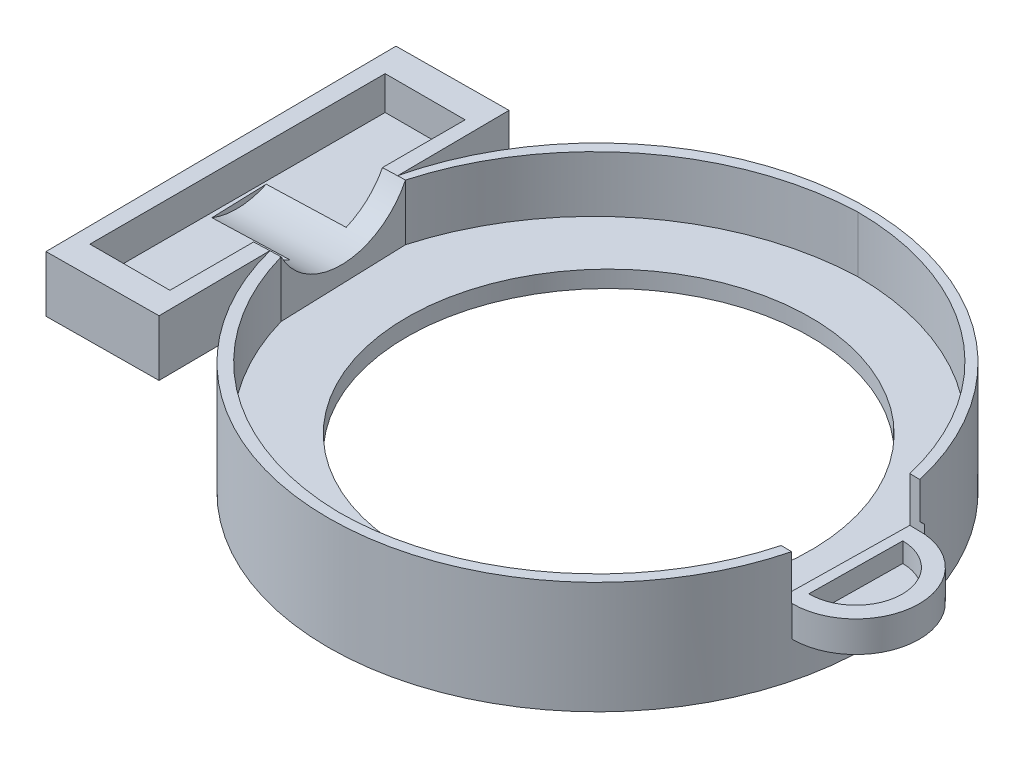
from build123d import *
from build123d.topology import SkipClean

# Parameters (mm, degrees)
SKETCH_1_R          = 23.2
SKETCH_1_R_2        = 18
EXTRUDE_1_DEPTH     = 1.5
EXTRUDE_START       = -5
SKETCH_2_R          = 24
SKETCH_2_R_2        = 23.2
EXTRUDE_2_DEPTH     = 5
SKETCH_3_R          = 1.25
EXTRUDE_3_DEPTH     = 0.45
EXTRUDE_4_DEPTH     = 5
SKETCH_5_W          = 31.472229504
SKETCH_5_H          = 5
EXTRUDE_5_DEPTH     = 10
CUT_EXTRUDE_1_DEPTH = 9
SKETCH_7_W          = 7.133746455
SKETCH_7_H          = 26.332621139
CUT_EXTRUDE_2_DEPTH = 3
EXTRUDE_7_DEPTH     = 1.75
CUT_EXTRUDE_3_DEPTH = 2.5
SKETCH_10_W         = 11.290385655
SKETCH_10_H         = 4
CUT_EXTRUDE_4_DEPTH = 8


with BuildPart() as part:
    # Sketch 1 → Extrude 1 (new body)
    with BuildSketch(Plane(origin=(0, 0, 0), x_dir=(1, 0, 0), z_dir=(0, 1, 0))):
        with Locations(Location((-1, 0, 0), (0, 0, 270))):
            Circle(SKETCH_1_R)
        with Locations(Location((0, 0, 0), (0, 0, 270))):
            Circle(SKETCH_1_R_2, mode=Mode.SUBTRACT)
    extrude(amount=EXTRUDE_1_DEPTH)

    # Sketch 2 → Extrude 2 (add)
    with BuildSketch(Plane(origin=(0, 1.5, 0), x_dir=(1, 0, 0), z_dir=(0, 1, 0)).offset(EXTRUDE_START)):
        with Locations(Location((-1, 0, 0), (0, 0, 270))):
            Circle(SKETCH_2_R)
        with Locations(Location((-1, 0, 0), (0, 0, 270))):
            Circle(SKETCH_2_R_2, mode=Mode.SUBTRACT)
    extrude(amount=EXTRUDE_2_DEPTH)

    # Sketch 3 → Extrude 3 (add)
    with BuildSketch(Plane(origin=(0, 0, 0), x_dir=(-1, 0, 0), z_dir=(0, -1, 0))):
        with Locations(Location((22, 0, 0), (0, 0, 270))):
            Circle(SKETCH_3_R)
    extrude(amount=EXTRUDE_3_DEPTH)

    # Sketch 4 → Extrude 4 (add)
    with SkipClean():  # the faces are left unmerged after this step: merging them gives an invalid solid
        with BuildSketch(Plane(origin=(0, 1.5, 0), x_dir=(1, 0, 0), z_dir=(0, 1, 0))):
            with BuildLine():
                Line((-24.256348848, -5.928088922), (-24.350949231, 5.543750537))
                ThreePointArc((-24.350949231, 5.543750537), (-15.882035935, 18.828834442), (-1, 24))
                ThreePointArc((-1, 24), (13.955580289, 18.770471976), (22.393608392, 5.360884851))
                Line((22.393608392, 5.360884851), (22.256348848, -5.928088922))
                ThreePointArc((22.256348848, -5.928088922), (13.726266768, -18.950912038), (-1, -24))
                ThreePointArc((-1, -24), (-15.726266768, -18.950912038), (-24.256348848, -5.928088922))
            make_face()
            with BuildLine():
                Line((-23.669992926, 5.543750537), (-23.286972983, -5.928088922))
                ThreePointArc((-23.286972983, -5.928088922), (-14.988987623, -18.184475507), (-1.0264218, -23.095924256))
                ThreePointArc((-1.0264218, -23.095924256), (4.274287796, -22.474570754), (9.291382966, -20.654582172))
                ThreePointArc((9.291382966, -20.654582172), (16.880598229, -14.580497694), (21.310780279, -5.928088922))
                Line((21.310780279, -5.928088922), (21.489328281, 5.360884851))
                ThreePointArc((21.489328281, 5.360884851), (13.351042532, 18.209088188), (-1, 23.244522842))
                ThreePointArc((-1, 23.244522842), (-15.232732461, 18.10536767), (-23.669992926, 5.543750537))
            make_face(mode=Mode.SUBTRACT)
        extrude(amount=EXTRUDE_4_DEPTH)

    # Sketch 5 → Extrude 5 (add)
    with SkipClean():  # the faces are left unmerged after this step: merging them gives an invalid solid
        with BuildSketch(Plane(origin=(-24.303581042, 0, 0.200414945), x_dir=(0.008246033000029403, 0, 0.9999660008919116), z_dir=(-0.9999660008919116, 0, 0.008246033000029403))):
            with Locations((-0.008246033, 4)):
                Rectangle(SKETCH_5_W, SKETCH_5_H)
        extrude(amount=EXTRUDE_5_DEPTH)

    # Sketch 6 → Cut-Extrude 1 (cut)
    with SkipClean():  # the faces are left unmerged after this step: merging them gives an invalid solid
        with BuildSketch(Plane(origin=(-23.458748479, 0, 0.783236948), x_dir=(-0.03336924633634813, 0, -0.9994430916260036), z_dir=(0.9994430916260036, 0, -0.03336924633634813))):
            with BuildLine():
                Line((-5.147718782, 6.5), (6.330513, 6.5))
                ThreePointArc((6.330513, 6.5), (0.591397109, 2.992666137), (-5.147718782, 6.5))
            make_face()
        extrude(amount=-CUT_EXTRUDE_1_DEPTH, mode=Mode.SUBTRACT)

    # Sketch 7 → Cut-Extrude 2 (cut)
    with SkipClean():  # the faces are left unmerged after this step: merging them gives an invalid solid
        with BuildSketch(Plane(origin=(0, 6.5, 0), x_dir=(1, 0, 0), z_dir=(0, 1, 0))):
            with Locations((-29.224383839, -0.311203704)):
                Rectangle(SKETCH_7_W, SKETCH_7_H)
        extrude(amount=-CUT_EXTRUDE_2_DEPTH, mode=Mode.SUBTRACT)

    # Sketch 8 → Extrude 7 (add, symmetric)
    with SkipClean():  # the faces are left unmerged after this step: merging them gives an invalid solid
        with BuildSketch(Plane(origin=(0, 1.5, 0), x_dir=(1, 0, 0), z_dir=(0, 1, 0))):
            with BuildLine():
                Line((22.393608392, 5.360884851), (22.256348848, -5.928088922))
                ThreePointArc((22.256348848, -5.928088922), (27.969465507, -0.352231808), (22.393608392, 5.360884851))
            make_face()
        extrude(amount=EXTRUDE_7_DEPTH, both=True)

    # Sketch 9 → Cut-Extrude 3 (cut)
    with SkipClean():  # the faces are left unmerged after this step: merging them gives an invalid solid
        with BuildSketch(Plane(origin=(0, 3.25, 0), x_dir=(1, 0, 0), z_dir=(0, 1, 0))):
            with BuildLine():
                Line((22.375233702, 3.849650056), (22.274554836, -4.430729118))
                ThreePointArc((22.274554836, -4.430729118), (26.465083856, -0.340878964), (22.375233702, 3.849650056))
            make_face()
        extrude(amount=-CUT_EXTRUDE_3_DEPTH, mode=Mode.SUBTRACT)

    # Sketch 10 → Cut-Extrude 4 (cut)
    with SkipClean():  # the faces are left unmerged after this step: merging them gives an invalid solid
        with BuildSketch(Plane(origin=(21.399186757, 0, 0.338452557), x_dir=(-0.015814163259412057, 0, 0.9998749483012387), z_dir=(-0.9998749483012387, 0, -0.015814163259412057))):
            with Locations((-0.054857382, 4.5)):
                Rectangle(SKETCH_10_W, SKETCH_10_H)
        extrude(amount=-CUT_EXTRUDE_4_DEPTH, mode=Mode.SUBTRACT)


solid = part.part
